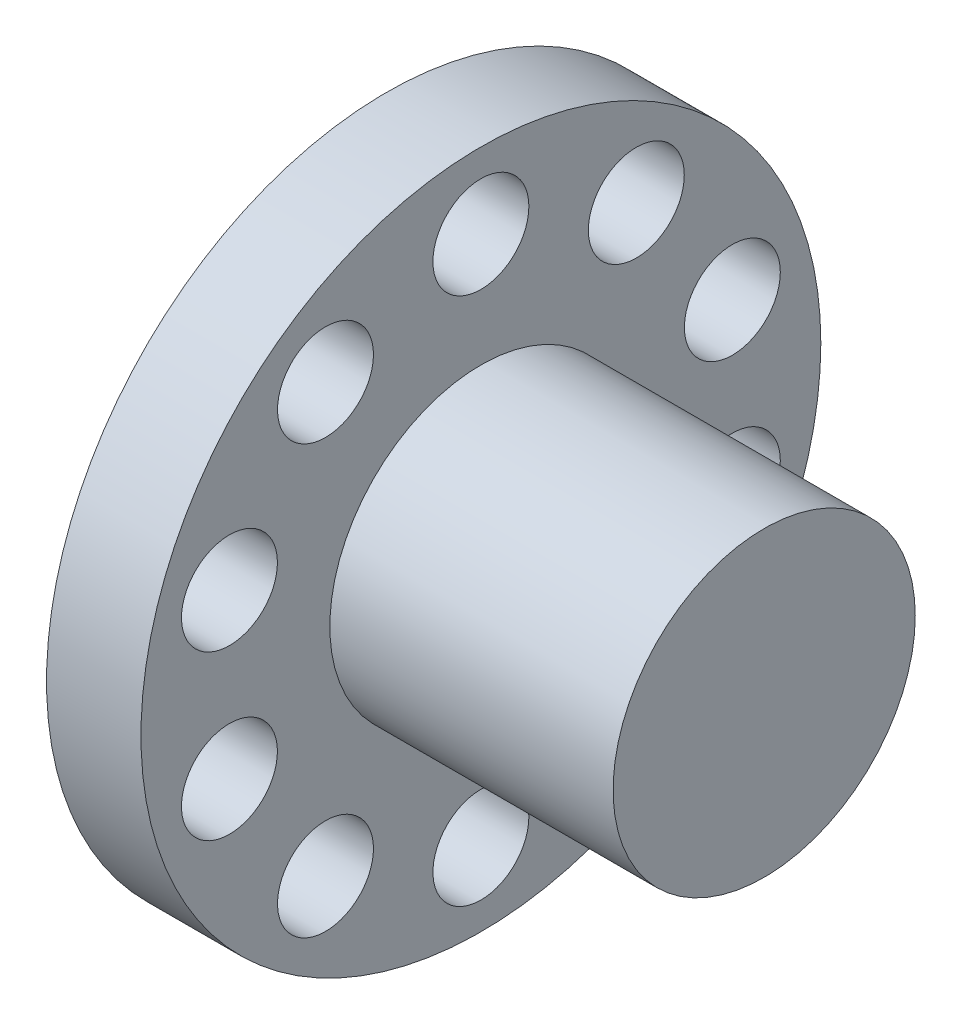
ISO-10303-21;
HEADER;
FILE_DESCRIPTION(('STEP AP214'),'2;1');
FILE_NAME('part.step','',(''),(''),'','','');
FILE_SCHEMA(('AUTOMOTIVE_DESIGN { 1 0 10303 214 1 1 1 1 }'));
ENDSEC;
DATA;
#1=APPLICATION_CONTEXT('core data for automotive mechanical design processes');
#2=APPLICATION_PROTOCOL_DEFINITION('international standard','automotive_design',2000,#1);
#3=PRODUCT_CONTEXT('',#1,'mechanical');
#4=PRODUCT('Part','Part','',(#3));
#5=PRODUCT_RELATED_PRODUCT_CATEGORY('part','',(#4));
#6=PRODUCT_DEFINITION_FORMATION('','',#4);
#7=PRODUCT_DEFINITION_CONTEXT('part definition',#1,'design');
#8=PRODUCT_DEFINITION('design','',#6,#7);
#9=PRODUCT_DEFINITION_SHAPE('','',#8);
#10=(LENGTH_UNIT() NAMED_UNIT(*) SI_UNIT(.MILLI.,.METRE.));
#11=(NAMED_UNIT(*) PLANE_ANGLE_UNIT() SI_UNIT($,.RADIAN.));
#12=(NAMED_UNIT(*) SI_UNIT($,.STERADIAN.) SOLID_ANGLE_UNIT());
#13=UNCERTAINTY_MEASURE_WITH_UNIT(LENGTH_MEASURE(1.E-05),#10,'distance_accuracy_value','');
#14=(GEOMETRIC_REPRESENTATION_CONTEXT(3) GLOBAL_UNCERTAINTY_ASSIGNED_CONTEXT((#13)) GLOBAL_UNIT_ASSIGNED_CONTEXT((#10,
#11,#12)) REPRESENTATION_CONTEXT('',''));
#15=CARTESIAN_POINT('',(0.,0.,0.));
#16=DIRECTION('',(0.,0.,1.));
#17=DIRECTION('',(1.,0.,0.));
#18=AXIS2_PLACEMENT_3D('',#15,#16,#17);
#19=CARTESIAN_POINT('',(0.,0.,0.));
#20=DIRECTION('',(-1.,0.,0.));
#21=DIRECTION('',(0.,0.,1.));
#22=AXIS2_PLACEMENT_3D('',#19,#20,#21);
#23=PLANE('',#22);
#24=CARTESIAN_POINT('',(0.,56.6311896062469,-41.1449676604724));
#25=DIRECTION('',(-1.,0.,0.));
#26=DIRECTION('',(0.,0.587785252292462,0.809016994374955));
#27=AXIS2_PLACEMENT_3D('',#24,#25,#26);
#28=CIRCLE('',#27,12.7);
#29=CARTESIAN_POINT('',(0.,64.0960623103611,-30.8704518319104));
#30=VERTEX_POINT('',#29);
#31=EDGE_CURVE('E114',#30,#30,#28,.T.);
#32=ORIENTED_EDGE('',*,*,#31,.F.);
#33=EDGE_LOOP('',(#32));
#34=FACE_BOUND('',#33,.T.);
#35=CARTESIAN_POINT('',(0.,21.6311896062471,-66.5739561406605));
#36=DIRECTION('',(-1.,0.,0.));
#37=DIRECTION('',(0.,0.95105651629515,0.309016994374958));
#38=AXIS2_PLACEMENT_3D('',#35,#36,#37);
#39=CIRCLE('',#38,12.7);
#40=CARTESIAN_POINT('',(0.,33.7096073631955,-62.6494403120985));
#41=VERTEX_POINT('',#40);
#42=EDGE_CURVE('E118',#41,#41,#39,.T.);
#43=ORIENTED_EDGE('',*,*,#42,.F.);
#44=EDGE_LOOP('',(#43));
#45=FACE_BOUND('',#44,.T.);
#46=CARTESIAN_POINT('',(0.,-21.6311896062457,-66.573956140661));
#47=DIRECTION('',(-1.,0.,0.));
#48=DIRECTION('',(0.,0.951056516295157,-0.309016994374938));
#49=AXIS2_PLACEMENT_3D('',#46,#47,#48);
#50=CIRCLE('',#49,12.7);
#51=CARTESIAN_POINT('',(0.,-9.55277184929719,-70.4984719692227));
#52=VERTEX_POINT('',#51);
#53=EDGE_CURVE('E122',#52,#52,#50,.T.);
#54=ORIENTED_EDGE('',*,*,#53,.F.);
#55=EDGE_LOOP('',(#54));
#56=FACE_BOUND('',#55,.T.);
#57=CARTESIAN_POINT('',(0.,-56.631189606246,-41.1449676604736));
#58=DIRECTION('',(-1.,0.,0.));
#59=DIRECTION('',(0.,0.58778525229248,-0.809016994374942));
#60=AXIS2_PLACEMENT_3D('',#57,#58,#59);
#61=CIRCLE('',#60,12.7);
#62=CARTESIAN_POINT('',(0.,-49.1663169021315,-51.4194834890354));
#63=VERTEX_POINT('',#62);
#64=EDGE_CURVE('E126',#63,#63,#61,.T.);
#65=ORIENTED_EDGE('',*,*,#64,.F.);
#66=EDGE_LOOP('',(#65));
#67=FACE_BOUND('',#66,.T.);
#68=CARTESIAN_POINT('',(0.,-70.,0.));
#69=DIRECTION('',(-1.,0.,0.));
#70=DIRECTION('',(0.,0.,-1.));
#71=AXIS2_PLACEMENT_3D('',#68,#69,#70);
#72=CIRCLE('',#71,12.7);
#73=CARTESIAN_POINT('',(0.,-70.,-12.7));
#74=VERTEX_POINT('',#73);
#75=EDGE_CURVE('E130',#74,#74,#72,.T.);
#76=ORIENTED_EDGE('',*,*,#75,.F.);
#77=EDGE_LOOP('',(#76));
#78=FACE_BOUND('',#77,.T.);
#79=CARTESIAN_POINT('',(0.,-56.6311896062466,41.1449676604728));
#80=DIRECTION('',(-1.,0.,0.));
#81=DIRECTION('',(0.,-0.587785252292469,-0.809016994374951));
#82=AXIS2_PLACEMENT_3D('',#79,#80,#81);
#83=CIRCLE('',#82,12.7);
#84=CARTESIAN_POINT('',(0.,-64.0960623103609,30.8704518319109));
#85=VERTEX_POINT('',#84);
#86=EDGE_CURVE('E134',#85,#85,#83,.T.);
#87=ORIENTED_EDGE('',*,*,#86,.F.);
#88=EDGE_LOOP('',(#87));
#89=FACE_BOUND('',#88,.T.);
#90=CARTESIAN_POINT('',(0.,-21.6311896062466,66.5739561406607));
#91=DIRECTION('',(-1.,0.,0.));
#92=DIRECTION('',(0.,-0.951056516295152,-0.309016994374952));
#93=AXIS2_PLACEMENT_3D('',#90,#91,#92);
#94=CIRCLE('',#93,12.7);
#95=CARTESIAN_POINT('',(0.,-33.7096073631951,62.6494403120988));
#96=VERTEX_POINT('',#95);
#97=EDGE_CURVE('E138',#96,#96,#94,.T.);
#98=ORIENTED_EDGE('',*,*,#97,.F.);
#99=EDGE_LOOP('',(#98));
#100=FACE_BOUND('',#99,.T.);
#101=CARTESIAN_POINT('',(0.,21.6311896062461,66.5739561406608));
#102=DIRECTION('',(-1.,0.,0.));
#103=DIRECTION('',(0.,-0.951056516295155,0.309016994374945));
#104=AXIS2_PLACEMENT_3D('',#101,#102,#103);
#105=CIRCLE('',#104,12.7);
#106=CARTESIAN_POINT('',(0.,9.55277184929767,70.4984719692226));
#107=VERTEX_POINT('',#106);
#108=EDGE_CURVE('E142',#107,#107,#105,.T.);
#109=ORIENTED_EDGE('',*,*,#108,.F.);
#110=EDGE_LOOP('',(#109));
#111=FACE_BOUND('',#110,.T.);
#112=CARTESIAN_POINT('',(0.,56.6311896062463,41.1449676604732));
#113=DIRECTION('',(-1.,0.,0.));
#114=DIRECTION('',(0.,-0.587785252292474,0.809016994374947));
#115=AXIS2_PLACEMENT_3D('',#112,#113,#114);
#116=CIRCLE('',#115,12.7);
#117=CARTESIAN_POINT('',(0.,49.1663169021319,51.419483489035));
#118=VERTEX_POINT('',#117);
#119=EDGE_CURVE('E57',#118,#118,#116,.T.);
#120=ORIENTED_EDGE('',*,*,#119,.F.);
#121=EDGE_LOOP('',(#120));
#122=FACE_BOUND('',#121,.T.);
#123=CARTESIAN_POINT('',(0.,70.,0.));
#124=DIRECTION('',(-1.,0.,0.));
#125=DIRECTION('',(0.,0.,1.));
#126=AXIS2_PLACEMENT_3D('',#123,#124,#125);
#127=CIRCLE('',#126,12.7);
#128=CARTESIAN_POINT('',(0.,70.,12.7));
#129=VERTEX_POINT('',#128);
#130=EDGE_CURVE('E52',#129,#129,#127,.T.);
#131=ORIENTED_EDGE('',*,*,#130,.F.);
#132=EDGE_LOOP('',(#131));
#133=FACE_BOUND('',#132,.T.);
#134=CARTESIAN_POINT('',(0.,0.,0.));
#135=DIRECTION('',(1.,0.,0.));
#136=DIRECTION('',(0.,0.,-1.));
#137=AXIS2_PLACEMENT_3D('',#134,#135,#136);
#138=CIRCLE('',#137,90.);
#139=CARTESIAN_POINT('',(0.,0.,-90.));
#140=VERTEX_POINT('',#139);
#141=EDGE_CURVE('E10',#140,#140,#138,.T.);
#142=ORIENTED_EDGE('',*,*,#141,.F.);
#143=EDGE_LOOP('',(#142));
#144=FACE_BOUND('',#143,.T.);
#145=ADVANCED_FACE('F32',(#34,#45,#56,#67,#78,#89,#100,#111,#122,#133,#144),#23,.T.);
#146=CARTESIAN_POINT('',(0.,0.,0.));
#147=DIRECTION('',(1.,0.,0.));
#148=DIRECTION('',(0.,0.,-1.));
#149=AXIS2_PLACEMENT_3D('',#146,#147,#148);
#150=CYLINDRICAL_SURFACE('',#149,90.);
#151=ORIENTED_EDGE('',*,*,#141,.T.);
#152=EDGE_LOOP('',(#151));
#153=FACE_BOUND('',#152,.T.);
#154=CARTESIAN_POINT('',(25.,0.,0.));
#155=DIRECTION('',(1.,0.,0.));
#156=DIRECTION('',(0.,0.,-1.));
#157=AXIS2_PLACEMENT_3D('',#154,#155,#156);
#158=CIRCLE('',#157,90.);
#159=CARTESIAN_POINT('',(25.,0.,-90.));
#160=VERTEX_POINT('',#159);
#161=EDGE_CURVE('E39',#160,#160,#158,.T.);
#162=ORIENTED_EDGE('',*,*,#161,.F.);
#163=EDGE_LOOP('',(#162));
#164=FACE_BOUND('',#163,.T.);
#165=ADVANCED_FACE('F97',(#153,#164),#150,.T.);
#166=CARTESIAN_POINT('',(25.,90.,0.));
#167=DIRECTION('',(1.,0.,0.));
#168=DIRECTION('',(0.,0.,-1.));
#169=AXIS2_PLACEMENT_3D('',#166,#167,#168);
#170=PLANE('',#169);
#171=CARTESIAN_POINT('',(25.,56.6311896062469,-41.1449676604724));
#172=DIRECTION('',(1.,0.,0.));
#173=DIRECTION('',(0.,0.,-1.));
#174=AXIS2_PLACEMENT_3D('',#171,#172,#173);
#175=CIRCLE('',#174,12.7);
#176=CARTESIAN_POINT('',(25.,56.6311896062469,-53.8449676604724));
#177=VERTEX_POINT('',#176);
#178=EDGE_CURVE('E35',#177,#177,#175,.T.);
#179=ORIENTED_EDGE('',*,*,#178,.F.);
#180=EDGE_LOOP('',(#179));
#181=FACE_BOUND('',#180,.T.);
#182=CARTESIAN_POINT('',(25.,21.6311896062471,-66.5739561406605));
#183=DIRECTION('',(1.,0.,0.));
#184=DIRECTION('',(0.,0.,-1.));
#185=AXIS2_PLACEMENT_3D('',#182,#183,#184);
#186=CIRCLE('',#185,12.7);
#187=CARTESIAN_POINT('',(25.,21.6311896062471,-79.2739561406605));
#188=VERTEX_POINT('',#187);
#189=EDGE_CURVE('E74',#188,#188,#186,.T.);
#190=ORIENTED_EDGE('',*,*,#189,.F.);
#191=EDGE_LOOP('',(#190));
#192=FACE_BOUND('',#191,.T.);
#193=CARTESIAN_POINT('',(25.,-21.6311896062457,-66.573956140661));
#194=DIRECTION('',(1.,0.,0.));
#195=DIRECTION('',(0.,0.,-1.));
#196=AXIS2_PLACEMENT_3D('',#193,#194,#195);
#197=CIRCLE('',#196,12.7);
#198=CARTESIAN_POINT('',(25.,-21.6311896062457,-79.273956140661));
#199=VERTEX_POINT('',#198);
#200=EDGE_CURVE('E72',#199,#199,#197,.T.);
#201=ORIENTED_EDGE('',*,*,#200,.F.);
#202=EDGE_LOOP('',(#201));
#203=FACE_BOUND('',#202,.T.);
#204=CARTESIAN_POINT('',(25.,-56.631189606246,-41.1449676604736));
#205=DIRECTION('',(1.,0.,0.));
#206=DIRECTION('',(0.,0.,-1.));
#207=AXIS2_PLACEMENT_3D('',#204,#205,#206);
#208=CIRCLE('',#207,12.7);
#209=CARTESIAN_POINT('',(25.,-56.631189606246,-53.8449676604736));
#210=VERTEX_POINT('',#209);
#211=EDGE_CURVE('E69',#210,#210,#208,.T.);
#212=ORIENTED_EDGE('',*,*,#211,.F.);
#213=EDGE_LOOP('',(#212));
#214=FACE_BOUND('',#213,.T.);
#215=CARTESIAN_POINT('',(25.,-70.,0.));
#216=DIRECTION('',(1.,0.,0.));
#217=DIRECTION('',(0.,0.,-1.));
#218=AXIS2_PLACEMENT_3D('',#215,#216,#217);
#219=CIRCLE('',#218,12.7);
#220=CARTESIAN_POINT('',(25.,-70.,-12.7));
#221=VERTEX_POINT('',#220);
#222=EDGE_CURVE('E66',#221,#221,#219,.T.);
#223=ORIENTED_EDGE('',*,*,#222,.F.);
#224=EDGE_LOOP('',(#223));
#225=FACE_BOUND('',#224,.T.);
#226=CARTESIAN_POINT('',(25.,-56.6311896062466,41.1449676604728));
#227=DIRECTION('',(1.,0.,0.));
#228=DIRECTION('',(0.,0.,-1.));
#229=AXIS2_PLACEMENT_3D('',#226,#227,#228);
#230=CIRCLE('',#229,12.7);
#231=CARTESIAN_POINT('',(25.,-56.6311896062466,28.4449676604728));
#232=VERTEX_POINT('',#231);
#233=EDGE_CURVE('E63',#232,#232,#230,.T.);
#234=ORIENTED_EDGE('',*,*,#233,.F.);
#235=EDGE_LOOP('',(#234));
#236=FACE_BOUND('',#235,.T.);
#237=CARTESIAN_POINT('',(25.,-21.6311896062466,66.5739561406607));
#238=DIRECTION('',(1.,0.,0.));
#239=DIRECTION('',(0.,0.,-1.));
#240=AXIS2_PLACEMENT_3D('',#237,#238,#239);
#241=CIRCLE('',#240,12.7);
#242=CARTESIAN_POINT('',(25.,-21.6311896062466,53.8739561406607));
#243=VERTEX_POINT('',#242);
#244=EDGE_CURVE('E60',#243,#243,#241,.T.);
#245=ORIENTED_EDGE('',*,*,#244,.F.);
#246=EDGE_LOOP('',(#245));
#247=FACE_BOUND('',#246,.T.);
#248=CARTESIAN_POINT('',(25.,21.6311896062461,66.5739561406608));
#249=DIRECTION('',(1.,0.,0.));
#250=DIRECTION('',(0.,0.,-1.));
#251=AXIS2_PLACEMENT_3D('',#248,#249,#250);
#252=CIRCLE('',#251,12.7);
#253=CARTESIAN_POINT('',(25.,21.6311896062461,53.8739561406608));
#254=VERTEX_POINT('',#253);
#255=EDGE_CURVE('E56',#254,#254,#252,.T.);
#256=ORIENTED_EDGE('',*,*,#255,.F.);
#257=EDGE_LOOP('',(#256));
#258=FACE_BOUND('',#257,.T.);
#259=CARTESIAN_POINT('',(25.,56.6311896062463,41.1449676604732));
#260=DIRECTION('',(1.,0.,0.));
#261=DIRECTION('',(0.,0.,-1.));
#262=AXIS2_PLACEMENT_3D('',#259,#260,#261);
#263=CIRCLE('',#262,12.7);
#264=CARTESIAN_POINT('',(25.,56.6311896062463,28.4449676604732));
#265=VERTEX_POINT('',#264);
#266=EDGE_CURVE('E53',#265,#265,#263,.T.);
#267=ORIENTED_EDGE('',*,*,#266,.F.);
#268=EDGE_LOOP('',(#267));
#269=FACE_BOUND('',#268,.T.);
#270=CARTESIAN_POINT('',(25.,70.,0.));
#271=DIRECTION('',(1.,0.,0.));
#272=DIRECTION('',(0.,0.,-1.));
#273=AXIS2_PLACEMENT_3D('',#270,#271,#272);
#274=CIRCLE('',#273,12.7);
#275=CARTESIAN_POINT('',(25.,70.,-12.7));
#276=VERTEX_POINT('',#275);
#277=EDGE_CURVE('E48',#276,#276,#274,.T.);
#278=ORIENTED_EDGE('',*,*,#277,.F.);
#279=EDGE_LOOP('',(#278));
#280=FACE_BOUND('',#279,.T.);
#281=ORIENTED_EDGE('',*,*,#161,.T.);
#282=EDGE_LOOP('',(#281));
#283=FACE_BOUND('',#282,.T.);
#284=CARTESIAN_POINT('',(25.,0.,0.));
#285=DIRECTION('',(1.,0.,0.));
#286=DIRECTION('',(0.,0.,-1.));
#287=AXIS2_PLACEMENT_3D('',#284,#285,#286);
#288=CIRCLE('',#287,40.);
#289=CARTESIAN_POINT('',(25.,0.,-40.));
#290=VERTEX_POINT('',#289);
#291=EDGE_CURVE('E44',#290,#290,#288,.T.);
#292=ORIENTED_EDGE('',*,*,#291,.F.);
#293=EDGE_LOOP('',(#292));
#294=FACE_BOUND('',#293,.T.);
#295=ADVANCED_FACE('F95',(#181,#192,#203,#214,#225,#236,#247,#258,#269,#280,#283,#294),#170,.T.);
#296=CARTESIAN_POINT('',(0.,0.,0.));
#297=DIRECTION('',(1.,0.,0.));
#298=DIRECTION('',(0.,0.,-1.));
#299=AXIS2_PLACEMENT_3D('',#296,#297,#298);
#300=CYLINDRICAL_SURFACE('',#299,40.);
#301=ORIENTED_EDGE('',*,*,#291,.T.);
#302=EDGE_LOOP('',(#301));
#303=FACE_BOUND('',#302,.T.);
#304=CARTESIAN_POINT('',(100.,0.,0.));
#305=DIRECTION('',(1.,0.,0.));
#306=DIRECTION('',(0.,0.,-1.));
#307=AXIS2_PLACEMENT_3D('',#304,#305,#306);
#308=CIRCLE('',#307,40.);
#309=CARTESIAN_POINT('',(100.,0.,-40.));
#310=VERTEX_POINT('',#309);
#311=EDGE_CURVE('E51',#310,#310,#308,.T.);
#312=ORIENTED_EDGE('',*,*,#311,.F.);
#313=EDGE_LOOP('',(#312));
#314=FACE_BOUND('',#313,.T.);
#315=ADVANCED_FACE('F92',(#303,#314),#300,.T.);
#316=CARTESIAN_POINT('',(100.,40.,0.));
#317=DIRECTION('',(1.,0.,0.));
#318=DIRECTION('',(0.,0.,-1.));
#319=AXIS2_PLACEMENT_3D('',#316,#317,#318);
#320=PLANE('',#319);
#321=ORIENTED_EDGE('',*,*,#311,.T.);
#322=EDGE_LOOP('',(#321));
#323=FACE_BOUND('',#322,.T.);
#324=ADVANCED_FACE('F104',(#323),#320,.T.);
#325=CARTESIAN_POINT('',(100.,70.,0.));
#326=DIRECTION('',(-1.,0.,0.));
#327=DIRECTION('',(0.,0.,1.));
#328=AXIS2_PLACEMENT_3D('',#325,#326,#327);
#329=CYLINDRICAL_SURFACE('',#328,12.7);
#330=ORIENTED_EDGE('',*,*,#277,.T.);
#331=EDGE_LOOP('',(#330));
#332=FACE_BOUND('',#331,.T.);
#333=ORIENTED_EDGE('',*,*,#130,.T.);
#334=EDGE_LOOP('',(#333));
#335=FACE_BOUND('',#334,.T.);
#336=ADVANCED_FACE('F172',(#332,#335),#329,.F.);
#337=CARTESIAN_POINT('',(100.,56.6311896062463,41.1449676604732));
#338=DIRECTION('',(-1.,0.,0.));
#339=DIRECTION('',(0.,0.,1.));
#340=AXIS2_PLACEMENT_3D('',#337,#338,#339);
#341=CYLINDRICAL_SURFACE('',#340,12.7);
#342=ORIENTED_EDGE('',*,*,#266,.T.);
#343=EDGE_LOOP('',(#342));
#344=FACE_BOUND('',#343,.T.);
#345=ORIENTED_EDGE('',*,*,#119,.T.);
#346=EDGE_LOOP('',(#345));
#347=FACE_BOUND('',#346,.T.);
#348=ADVANCED_FACE('F168',(#344,#347),#341,.F.);
#349=CARTESIAN_POINT('',(100.,21.6311896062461,66.5739561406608));
#350=DIRECTION('',(-1.,0.,0.));
#351=DIRECTION('',(0.,0.,1.));
#352=AXIS2_PLACEMENT_3D('',#349,#350,#351);
#353=CYLINDRICAL_SURFACE('',#352,12.7);
#354=ORIENTED_EDGE('',*,*,#255,.T.);
#355=EDGE_LOOP('',(#354));
#356=FACE_BOUND('',#355,.T.);
#357=ORIENTED_EDGE('',*,*,#108,.T.);
#358=EDGE_LOOP('',(#357));
#359=FACE_BOUND('',#358,.T.);
#360=ADVANCED_FACE('F171',(#356,#359),#353,.F.);
#361=CARTESIAN_POINT('',(100.,-21.6311896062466,66.5739561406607));
#362=DIRECTION('',(-1.,0.,0.));
#363=DIRECTION('',(0.,0.,1.));
#364=AXIS2_PLACEMENT_3D('',#361,#362,#363);
#365=CYLINDRICAL_SURFACE('',#364,12.7);
#366=ORIENTED_EDGE('',*,*,#244,.T.);
#367=EDGE_LOOP('',(#366));
#368=FACE_BOUND('',#367,.T.);
#369=ORIENTED_EDGE('',*,*,#97,.T.);
#370=EDGE_LOOP('',(#369));
#371=FACE_BOUND('',#370,.T.);
#372=ADVANCED_FACE('F198',(#368,#371),#365,.F.);
#373=CARTESIAN_POINT('',(100.,-56.6311896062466,41.1449676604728));
#374=DIRECTION('',(-1.,0.,0.));
#375=DIRECTION('',(0.,0.,1.));
#376=AXIS2_PLACEMENT_3D('',#373,#374,#375);
#377=CYLINDRICAL_SURFACE('',#376,12.7);
#378=ORIENTED_EDGE('',*,*,#233,.T.);
#379=EDGE_LOOP('',(#378));
#380=FACE_BOUND('',#379,.T.);
#381=ORIENTED_EDGE('',*,*,#86,.T.);
#382=EDGE_LOOP('',(#381));
#383=FACE_BOUND('',#382,.T.);
#384=ADVANCED_FACE('F206',(#380,#383),#377,.F.);
#385=CARTESIAN_POINT('',(100.,-70.,0.));
#386=DIRECTION('',(-1.,0.,0.));
#387=DIRECTION('',(0.,0.,1.));
#388=AXIS2_PLACEMENT_3D('',#385,#386,#387);
#389=CYLINDRICAL_SURFACE('',#388,12.7);
#390=ORIENTED_EDGE('',*,*,#222,.T.);
#391=EDGE_LOOP('',(#390));
#392=FACE_BOUND('',#391,.T.);
#393=ORIENTED_EDGE('',*,*,#75,.T.);
#394=EDGE_LOOP('',(#393));
#395=FACE_BOUND('',#394,.T.);
#396=ADVANCED_FACE('F214',(#392,#395),#389,.F.);
#397=CARTESIAN_POINT('',(100.,-56.631189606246,-41.1449676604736));
#398=DIRECTION('',(-1.,0.,0.));
#399=DIRECTION('',(0.,0.,1.));
#400=AXIS2_PLACEMENT_3D('',#397,#398,#399);
#401=CYLINDRICAL_SURFACE('',#400,12.7);
#402=ORIENTED_EDGE('',*,*,#211,.T.);
#403=EDGE_LOOP('',(#402));
#404=FACE_BOUND('',#403,.T.);
#405=ORIENTED_EDGE('',*,*,#64,.T.);
#406=EDGE_LOOP('',(#405));
#407=FACE_BOUND('',#406,.T.);
#408=ADVANCED_FACE('F222',(#404,#407),#401,.F.);
#409=CARTESIAN_POINT('',(100.,-21.6311896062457,-66.573956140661));
#410=DIRECTION('',(-1.,0.,0.));
#411=DIRECTION('',(0.,0.,1.));
#412=AXIS2_PLACEMENT_3D('',#409,#410,#411);
#413=CYLINDRICAL_SURFACE('',#412,12.7);
#414=ORIENTED_EDGE('',*,*,#200,.T.);
#415=EDGE_LOOP('',(#414));
#416=FACE_BOUND('',#415,.T.);
#417=ORIENTED_EDGE('',*,*,#53,.T.);
#418=EDGE_LOOP('',(#417));
#419=FACE_BOUND('',#418,.T.);
#420=ADVANCED_FACE('F164',(#416,#419),#413,.F.);
#421=CARTESIAN_POINT('',(100.,21.6311896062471,-66.5739561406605));
#422=DIRECTION('',(-1.,0.,0.));
#423=DIRECTION('',(0.,0.,1.));
#424=AXIS2_PLACEMENT_3D('',#421,#422,#423);
#425=CYLINDRICAL_SURFACE('',#424,12.7);
#426=ORIENTED_EDGE('',*,*,#189,.T.);
#427=EDGE_LOOP('',(#426));
#428=FACE_BOUND('',#427,.T.);
#429=ORIENTED_EDGE('',*,*,#42,.T.);
#430=EDGE_LOOP('',(#429));
#431=FACE_BOUND('',#430,.T.);
#432=ADVANCED_FACE('F159',(#428,#431),#425,.F.);
#433=CARTESIAN_POINT('',(100.,56.6311896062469,-41.1449676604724));
#434=DIRECTION('',(-1.,0.,0.));
#435=DIRECTION('',(0.,0.,1.));
#436=AXIS2_PLACEMENT_3D('',#433,#434,#435);
#437=CYLINDRICAL_SURFACE('',#436,12.7);
#438=ORIENTED_EDGE('',*,*,#178,.T.);
#439=EDGE_LOOP('',(#438));
#440=FACE_BOUND('',#439,.T.);
#441=ORIENTED_EDGE('',*,*,#31,.T.);
#442=EDGE_LOOP('',(#441));
#443=FACE_BOUND('',#442,.T.);
#444=ADVANCED_FACE('F157',(#440,#443),#437,.F.);
#445=CLOSED_SHELL('',(#145,#165,#295,#315,#324,#336,#348,#360,#372,#384,#396,#408,#420,#432,#444));
#446=MANIFOLD_SOLID_BREP('B2',#445);
#447=ADVANCED_BREP_SHAPE_REPRESENTATION('',(#18,#446),#14);
#448=SHAPE_DEFINITION_REPRESENTATION(#9,#447);
ENDSEC;
END-ISO-10303-21;
